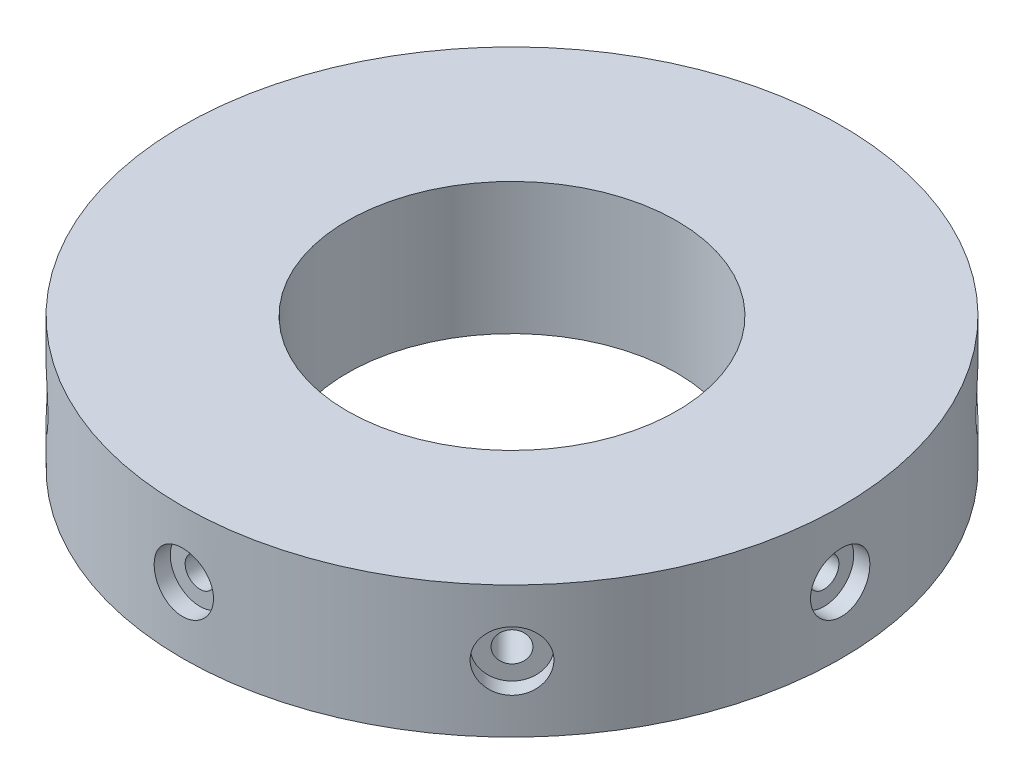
from build123d import *

# Parameters (mm, degrees)
SKETCH1_R           = 100
SKETCH1_R_2         = 50
BOSS_EXTRUDE1_DEPTH = 40
CIRPATTERN1_COUNT   = 8


with BuildPart() as part:
    # Sketch1 → Boss-Extrude1 (new body)
    with BuildSketch(Plane(origin=(0, 0, 0), x_dir=(1, 0, 0), z_dir=(0, 1, 0))):
        with Locations(Location((0, 0, 0), (0, 0, 270))):
            Circle(SKETCH1_R)
        with Locations(Location((0, 0, 0), (0, 0, 270))):
            Circle(SKETCH1_R_2, mode=Mode.SUBTRACT)
    extrude(amount=BOSS_EXTRUDE1_DEPTH)

    # Sketch2 → CBORE for M8 Hex Head Bolt1 (revolve, cut)
    with BuildSketch(Plane(origin=(0, 20, 100), x_dir=(0, -1, 0), z_dir=(1, 0, 0))):
        Polygon((0, 0), (0, 27.703872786), (4.5, 25), (4.5, 5.3), (9.0055, 5.3), (9.0055, 0), align=None)
    cbore_for_m8_hex_head_bolt1 = revolve(axis=Axis((0, 20, 106.35), (0, 0, -1)), mode=Mode.SUBTRACT)

    # CirPattern1: CBORE for M8 Hex Head Bolt1 ×8 about axis
    cirpattern1_axis = Axis((0, 0, 0), (0, 1, 0))
    for i in range(1, CIRPATTERN1_COUNT):
        add(cbore_for_m8_hex_head_bolt1.rotate(cirpattern1_axis, i * 360 / CIRPATTERN1_COUNT), mode=Mode.SUBTRACT)


solid = part.part
